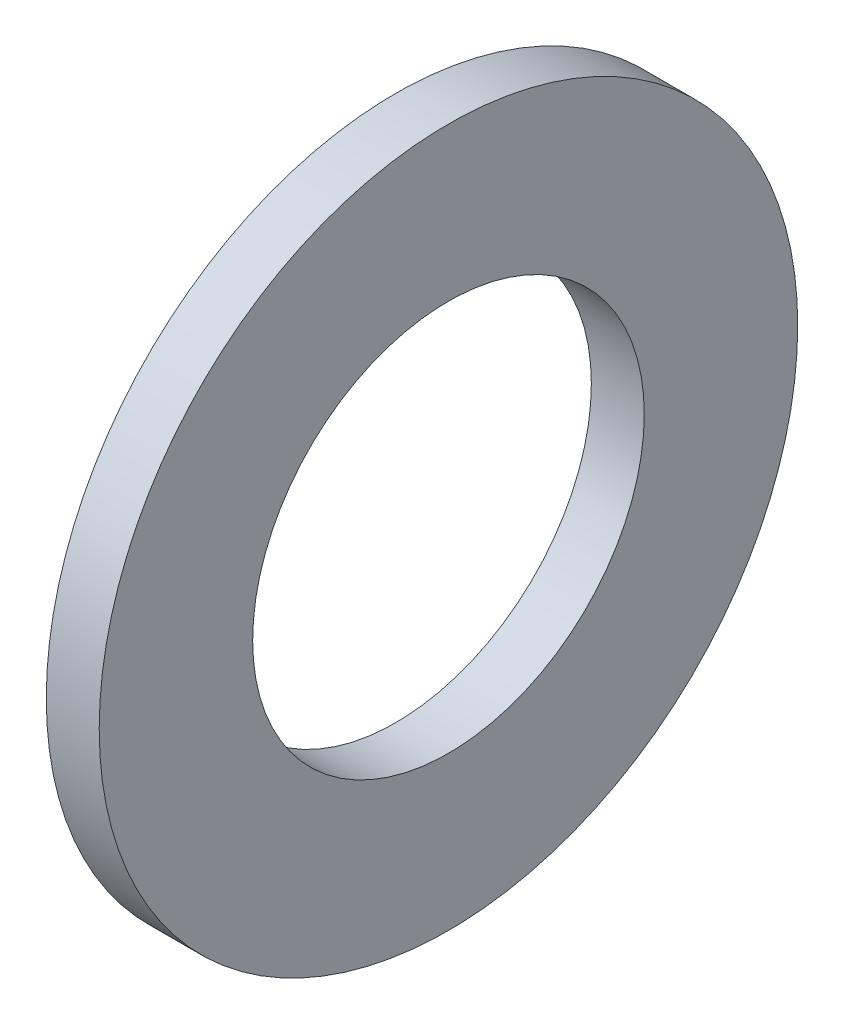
from build123d import *

# Parameters (mm, degrees)
SKETCH1_W = 5
SKETCH1_H = 14.5


with BuildPart() as part:
    # Sketch1 → Base-Revolve (revolve)
    with BuildSketch(Plane.XY, mode=Mode.PRIVATE) as base_revolve_sk:
        with Locations((-2.5, 25.75)):
            Rectangle(SKETCH1_W, SKETCH1_H)
    revolve(base_revolve_sk.sketch.rotate(Axis((-34.925, 0, 0), (1, 0, 0)), 90), axis=Axis((-34.925, 0, 0), (1, 0, 0)))


solid = part.part
